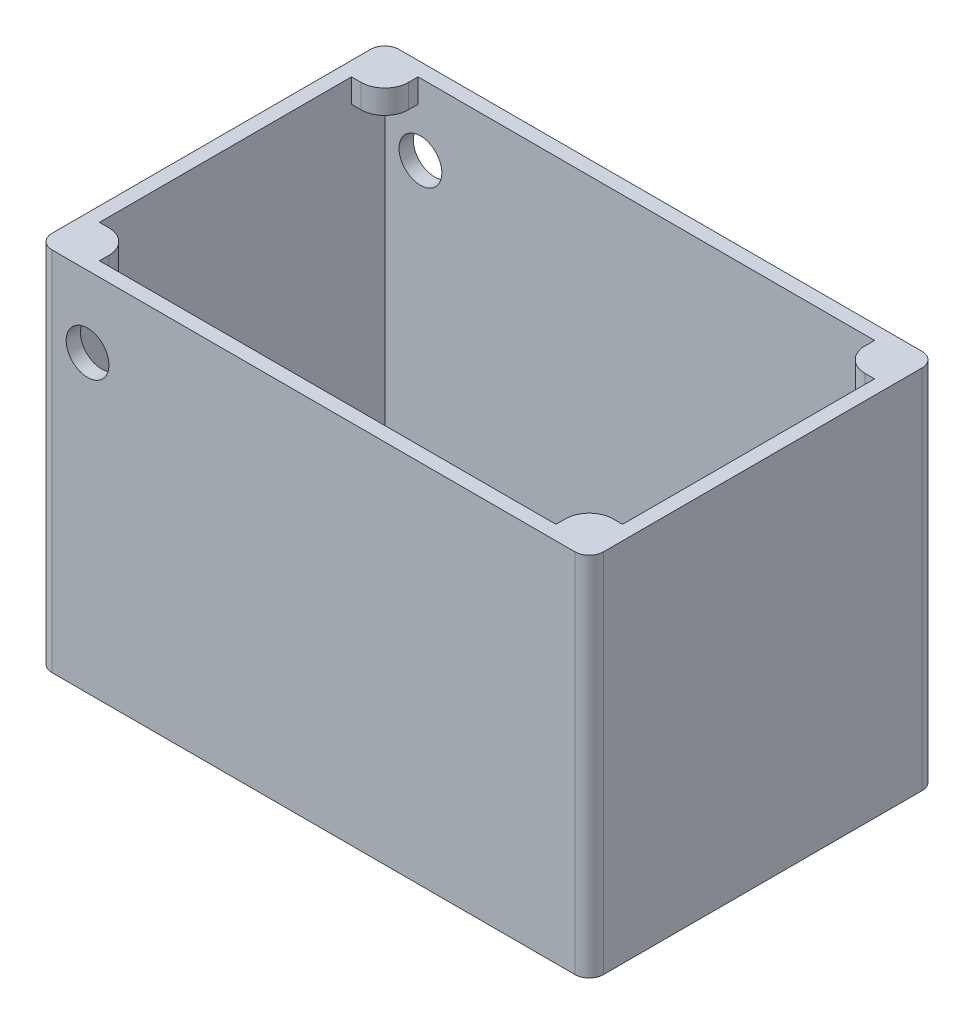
ISO-10303-21;
HEADER;
FILE_DESCRIPTION(('STEP AP214'),'2;1');
FILE_NAME('part.step','',(''),(''),'','','');
FILE_SCHEMA(('AUTOMOTIVE_DESIGN { 1 0 10303 214 1 1 1 1 }'));
ENDSEC;
DATA;
#1=APPLICATION_CONTEXT('core data for automotive mechanical design processes');
#2=APPLICATION_PROTOCOL_DEFINITION('international standard','automotive_design',2000,#1);
#3=PRODUCT_CONTEXT('',#1,'mechanical');
#4=PRODUCT('Part','Part','',(#3));
#5=PRODUCT_RELATED_PRODUCT_CATEGORY('part','',(#4));
#6=PRODUCT_DEFINITION_FORMATION('','',#4);
#7=PRODUCT_DEFINITION_CONTEXT('part definition',#1,'design');
#8=PRODUCT_DEFINITION('design','',#6,#7);
#9=PRODUCT_DEFINITION_SHAPE('','',#8);
#10=(LENGTH_UNIT() NAMED_UNIT(*) SI_UNIT(.MILLI.,.METRE.));
#11=(NAMED_UNIT(*) PLANE_ANGLE_UNIT() SI_UNIT($,.RADIAN.));
#12=(NAMED_UNIT(*) SI_UNIT($,.STERADIAN.) SOLID_ANGLE_UNIT());
#13=UNCERTAINTY_MEASURE_WITH_UNIT(LENGTH_MEASURE(1.E-05),#10,'distance_accuracy_value','');
#14=(GEOMETRIC_REPRESENTATION_CONTEXT(3) GLOBAL_UNCERTAINTY_ASSIGNED_CONTEXT((#13)) GLOBAL_UNIT_ASSIGNED_CONTEXT((#10,
#11,#12)) REPRESENTATION_CONTEXT('',''));
#15=CARTESIAN_POINT('',(0.,0.,0.));
#16=DIRECTION('',(0.,0.,1.));
#17=DIRECTION('',(1.,0.,0.));
#18=AXIS2_PLACEMENT_3D('',#15,#16,#17);
#19=CARTESIAN_POINT('',(53.,72.,31.5));
#20=DIRECTION('',(0.,1.,0.));
#21=DIRECTION('',(0.,0.,1.));
#22=AXIS2_PLACEMENT_3D('',#19,#20,#21);
#23=CYLINDRICAL_SURFACE('',#22,5.);
#24=DIRECTION('',(0.,1.,0.));
#25=VECTOR('',#24,1.);
#26=CARTESIAN_POINT('',(53.,72.,26.5));
#27=LINE('',#26,#25);
#28=CARTESIAN_POINT('',(53.,72.,26.5));
#29=VERTEX_POINT('',#28);
#30=CARTESIAN_POINT('',(53.,77.,26.5));
#31=VERTEX_POINT('',#30);
#32=EDGE_CURVE('E414',#29,#31,#27,.T.);
#33=ORIENTED_EDGE('',*,*,#32,.F.);
#34=CARTESIAN_POINT('',(53.,72.,31.5));
#35=DIRECTION('',(0.,1.,0.));
#36=DIRECTION('',(0.,0.,1.));
#37=AXIS2_PLACEMENT_3D('',#34,#35,#36);
#38=CIRCLE('',#37,5.);
#39=CARTESIAN_POINT('',(48.,72.,31.5));
#40=VERTEX_POINT('',#39);
#41=EDGE_CURVE('E40',#40,#29,#38,.F.);
#42=ORIENTED_EDGE('',*,*,#41,.F.);
#43=DIRECTION('',(0.,1.,0.));
#44=VECTOR('',#43,1.);
#45=CARTESIAN_POINT('',(48.,72.,31.5));
#46=LINE('',#45,#44);
#47=CARTESIAN_POINT('',(48.,77.,31.5));
#48=VERTEX_POINT('',#47);
#49=EDGE_CURVE('E417',#48,#40,#46,.F.);
#50=ORIENTED_EDGE('',*,*,#49,.F.);
#51=CARTESIAN_POINT('',(53.,77.,31.5));
#52=DIRECTION('',(0.,-1.,0.));
#53=DIRECTION('',(0.,0.,-1.));
#54=AXIS2_PLACEMENT_3D('',#51,#52,#53);
#55=CIRCLE('',#54,5.);
#56=EDGE_CURVE('E11',#31,#48,#55,.F.);
#57=ORIENTED_EDGE('',*,*,#56,.F.);
#58=EDGE_LOOP('',(#33,#42,#50,#57));
#59=FACE_BOUND('',#58,.T.);
#60=ADVANCED_FACE('F33',(#59),#23,.T.);
#61=CARTESIAN_POINT('',(53.,72.,-31.5));
#62=DIRECTION('',(0.,-1.,0.));
#63=DIRECTION('',(0.,0.,-1.));
#64=AXIS2_PLACEMENT_3D('',#61,#62,#63);
#65=CYLINDRICAL_SURFACE('',#64,5.);
#66=DIRECTION('',(0.,-1.,0.));
#67=VECTOR('',#66,1.);
#68=CARTESIAN_POINT('',(53.,72.,-26.5));
#69=LINE('',#68,#67);
#70=CARTESIAN_POINT('',(53.,77.,-26.5));
#71=VERTEX_POINT('',#70);
#72=CARTESIAN_POINT('',(53.,72.,-26.5));
#73=VERTEX_POINT('',#72);
#74=EDGE_CURVE('E406',#71,#73,#69,.T.);
#75=ORIENTED_EDGE('',*,*,#74,.F.);
#76=CARTESIAN_POINT('',(53.,77.,-31.5));
#77=DIRECTION('',(0.,-1.,0.));
#78=DIRECTION('',(0.,0.,-1.));
#79=AXIS2_PLACEMENT_3D('',#76,#77,#78);
#80=CIRCLE('',#79,5.);
#81=CARTESIAN_POINT('',(48.,77.,-31.5));
#82=VERTEX_POINT('',#81);
#83=EDGE_CURVE('E410',#82,#71,#80,.F.);
#84=ORIENTED_EDGE('',*,*,#83,.F.);
#85=DIRECTION('',(0.,-1.,0.));
#86=VECTOR('',#85,1.);
#87=CARTESIAN_POINT('',(48.,72.,-31.5));
#88=LINE('',#87,#86);
#89=CARTESIAN_POINT('',(48.,72.,-31.5));
#90=VERTEX_POINT('',#89);
#91=EDGE_CURVE('E241',#90,#82,#88,.F.);
#92=ORIENTED_EDGE('',*,*,#91,.F.);
#93=CARTESIAN_POINT('',(53.,72.,-31.5));
#94=DIRECTION('',(0.,-1.,0.));
#95=DIRECTION('',(0.,0.,-1.));
#96=AXIS2_PLACEMENT_3D('',#93,#94,#95);
#97=CIRCLE('',#96,5.);
#98=EDGE_CURVE('E412',#73,#90,#97,.T.);
#99=ORIENTED_EDGE('',*,*,#98,.F.);
#100=EDGE_LOOP('',(#75,#84,#92,#99));
#101=FACE_BOUND('',#100,.T.);
#102=ADVANCED_FACE('F450',(#101),#65,.T.);
#103=CARTESIAN_POINT('',(-53.,72.,31.5));
#104=DIRECTION('',(0.,-1.,0.));
#105=DIRECTION('',(0.,0.,-1.));
#106=AXIS2_PLACEMENT_3D('',#103,#104,#105);
#107=CYLINDRICAL_SURFACE('',#106,5.);
#108=DIRECTION('',(0.,-1.,0.));
#109=VECTOR('',#108,1.);
#110=CARTESIAN_POINT('',(-53.,72.,26.5));
#111=LINE('',#110,#109);
#112=CARTESIAN_POINT('',(-53.,77.,26.5));
#113=VERTEX_POINT('',#112);
#114=CARTESIAN_POINT('',(-53.,72.,26.5));
#115=VERTEX_POINT('',#114);
#116=EDGE_CURVE('E396',#113,#115,#111,.T.);
#117=ORIENTED_EDGE('',*,*,#116,.F.);
#118=CARTESIAN_POINT('',(-53.,77.,31.5));
#119=DIRECTION('',(0.,-1.,0.));
#120=DIRECTION('',(0.,0.,-1.));
#121=AXIS2_PLACEMENT_3D('',#118,#119,#120);
#122=CIRCLE('',#121,5.);
#123=CARTESIAN_POINT('',(-48.,77.,31.5));
#124=VERTEX_POINT('',#123);
#125=EDGE_CURVE('E402',#124,#113,#122,.F.);
#126=ORIENTED_EDGE('',*,*,#125,.F.);
#127=DIRECTION('',(0.,-1.,0.));
#128=VECTOR('',#127,1.);
#129=CARTESIAN_POINT('',(-48.,72.,31.5));
#130=LINE('',#129,#128);
#131=CARTESIAN_POINT('',(-48.,72.,31.5));
#132=VERTEX_POINT('',#131);
#133=EDGE_CURVE('E399',#132,#124,#130,.F.);
#134=ORIENTED_EDGE('',*,*,#133,.F.);
#135=CARTESIAN_POINT('',(-53.,72.,31.5));
#136=DIRECTION('',(0.,-1.,0.));
#137=DIRECTION('',(0.,0.,-1.));
#138=AXIS2_PLACEMENT_3D('',#135,#136,#137);
#139=CIRCLE('',#138,5.);
#140=EDGE_CURVE('E404',#115,#132,#139,.T.);
#141=ORIENTED_EDGE('',*,*,#140,.F.);
#142=EDGE_LOOP('',(#117,#126,#134,#141));
#143=FACE_BOUND('',#142,.T.);
#144=ADVANCED_FACE('F452',(#143),#107,.T.);
#145=CARTESIAN_POINT('',(-53.,72.,-31.5));
#146=DIRECTION('',(0.,1.,0.));
#147=DIRECTION('',(0.,0.,1.));
#148=AXIS2_PLACEMENT_3D('',#145,#146,#147);
#149=CYLINDRICAL_SURFACE('',#148,5.);
#150=DIRECTION('',(0.,1.,0.));
#151=VECTOR('',#150,1.);
#152=CARTESIAN_POINT('',(-53.,72.,-26.5));
#153=LINE('',#152,#151);
#154=CARTESIAN_POINT('',(-53.,72.,-26.5));
#155=VERTEX_POINT('',#154);
#156=CARTESIAN_POINT('',(-53.,77.,-26.5));
#157=VERTEX_POINT('',#156);
#158=EDGE_CURVE('E386',#155,#157,#153,.T.);
#159=ORIENTED_EDGE('',*,*,#158,.F.);
#160=CARTESIAN_POINT('',(-53.,72.,-31.5));
#161=DIRECTION('',(0.,1.,0.));
#162=DIRECTION('',(0.,0.,1.));
#163=AXIS2_PLACEMENT_3D('',#160,#161,#162);
#164=CIRCLE('',#163,5.);
#165=CARTESIAN_POINT('',(-48.,72.,-31.5));
#166=VERTEX_POINT('',#165);
#167=EDGE_CURVE('E392',#166,#155,#164,.F.);
#168=ORIENTED_EDGE('',*,*,#167,.F.);
#169=DIRECTION('',(0.,1.,0.));
#170=VECTOR('',#169,1.);
#171=CARTESIAN_POINT('',(-48.,72.,-31.5));
#172=LINE('',#171,#170);
#173=CARTESIAN_POINT('',(-48.,77.,-31.5));
#174=VERTEX_POINT('',#173);
#175=EDGE_CURVE('E389',#174,#166,#172,.F.);
#176=ORIENTED_EDGE('',*,*,#175,.F.);
#177=CARTESIAN_POINT('',(-53.,77.,-31.5));
#178=DIRECTION('',(0.,-1.,0.));
#179=DIRECTION('',(0.,0.,-1.));
#180=AXIS2_PLACEMENT_3D('',#177,#178,#179);
#181=CIRCLE('',#180,5.);
#182=EDGE_CURVE('E394',#157,#174,#181,.F.);
#183=ORIENTED_EDGE('',*,*,#182,.F.);
#184=EDGE_LOOP('',(#159,#168,#176,#183));
#185=FACE_BOUND('',#184,.T.);
#186=ADVANCED_FACE('F457',(#185),#149,.T.);
#187=CARTESIAN_POINT('',(55.,77.,-33.5));
#188=DIRECTION('',(0.,1.,0.));
#189=DIRECTION('',(0.,0.,1.));
#190=AXIS2_PLACEMENT_3D('',#187,#188,#189);
#191=CYLINDRICAL_SURFACE('',#190,3.);
#192=DIRECTION('',(0.,1.,0.));
#193=VECTOR('',#192,1.);
#194=CARTESIAN_POINT('',(58.,77.,-33.5));
#195=LINE('',#194,#193);
#196=CARTESIAN_POINT('',(58.,0.,-33.5));
#197=VERTEX_POINT('',#196);
#198=CARTESIAN_POINT('',(58.,77.,-33.5));
#199=VERTEX_POINT('',#198);
#200=EDGE_CURVE('E376',#197,#199,#195,.T.);
#201=ORIENTED_EDGE('',*,*,#200,.F.);
#202=CARTESIAN_POINT('',(55.,0.,-33.5));
#203=DIRECTION('',(0.,-1.,0.));
#204=DIRECTION('',(0.,0.,-1.));
#205=AXIS2_PLACEMENT_3D('',#202,#203,#204);
#206=CIRCLE('',#205,3.);
#207=CARTESIAN_POINT('',(55.,0.,-36.5));
#208=VERTEX_POINT('',#207);
#209=EDGE_CURVE('E382',#208,#197,#206,.T.);
#210=ORIENTED_EDGE('',*,*,#209,.F.);
#211=DIRECTION('',(0.,1.,0.));
#212=VECTOR('',#211,1.);
#213=CARTESIAN_POINT('',(55.,77.,-36.5));
#214=LINE('',#213,#212);
#215=CARTESIAN_POINT('',(55.,77.,-36.5));
#216=VERTEX_POINT('',#215);
#217=EDGE_CURVE('E379',#216,#208,#214,.F.);
#218=ORIENTED_EDGE('',*,*,#217,.F.);
#219=CARTESIAN_POINT('',(55.,77.,-33.5));
#220=DIRECTION('',(0.,-1.,0.));
#221=DIRECTION('',(0.,0.,-1.));
#222=AXIS2_PLACEMENT_3D('',#219,#220,#221);
#223=CIRCLE('',#222,3.);
#224=EDGE_CURVE('E384',#199,#216,#223,.F.);
#225=ORIENTED_EDGE('',*,*,#224,.F.);
#226=EDGE_LOOP('',(#201,#210,#218,#225));
#227=FACE_BOUND('',#226,.T.);
#228=ADVANCED_FACE('F463',(#227),#191,.T.);
#229=CARTESIAN_POINT('',(55.,77.,33.5));
#230=DIRECTION('',(0.,-1.,0.));
#231=DIRECTION('',(0.,0.,-1.));
#232=AXIS2_PLACEMENT_3D('',#229,#230,#231);
#233=CYLINDRICAL_SURFACE('',#232,3.);
#234=DIRECTION('',(0.,-1.,0.));
#235=VECTOR('',#234,1.);
#236=CARTESIAN_POINT('',(58.,77.,33.5));
#237=LINE('',#236,#235);
#238=CARTESIAN_POINT('',(58.,77.,33.5));
#239=VERTEX_POINT('',#238);
#240=CARTESIAN_POINT('',(58.,0.,33.5));
#241=VERTEX_POINT('',#240);
#242=EDGE_CURVE('E366',#239,#241,#237,.T.);
#243=ORIENTED_EDGE('',*,*,#242,.F.);
#244=CARTESIAN_POINT('',(55.,77.,33.5));
#245=DIRECTION('',(0.,-1.,0.));
#246=DIRECTION('',(0.,0.,-1.));
#247=AXIS2_PLACEMENT_3D('',#244,#245,#246);
#248=CIRCLE('',#247,3.);
#249=CARTESIAN_POINT('',(55.,77.,36.5));
#250=VERTEX_POINT('',#249);
#251=EDGE_CURVE('E372',#250,#239,#248,.F.);
#252=ORIENTED_EDGE('',*,*,#251,.F.);
#253=DIRECTION('',(0.,-1.,0.));
#254=VECTOR('',#253,1.);
#255=CARTESIAN_POINT('',(55.,77.,36.5));
#256=LINE('',#255,#254);
#257=CARTESIAN_POINT('',(55.,0.,36.5));
#258=VERTEX_POINT('',#257);
#259=EDGE_CURVE('E369',#258,#250,#256,.F.);
#260=ORIENTED_EDGE('',*,*,#259,.F.);
#261=CARTESIAN_POINT('',(55.,0.,33.5));
#262=DIRECTION('',(0.,-1.,0.));
#263=DIRECTION('',(0.,0.,-1.));
#264=AXIS2_PLACEMENT_3D('',#261,#262,#263);
#265=CIRCLE('',#264,3.);
#266=EDGE_CURVE('E374',#241,#258,#265,.T.);
#267=ORIENTED_EDGE('',*,*,#266,.F.);
#268=EDGE_LOOP('',(#243,#252,#260,#267));
#269=FACE_BOUND('',#268,.T.);
#270=ADVANCED_FACE('F467',(#269),#233,.T.);
#271=CARTESIAN_POINT('',(-55.,77.,33.5));
#272=DIRECTION('',(0.,-1.,0.));
#273=DIRECTION('',(0.,0.,-1.));
#274=AXIS2_PLACEMENT_3D('',#271,#272,#273);
#275=CYLINDRICAL_SURFACE('',#274,3.);
#276=DIRECTION('',(0.,-1.,0.));
#277=VECTOR('',#276,1.);
#278=CARTESIAN_POINT('',(-55.,77.,36.5));
#279=LINE('',#278,#277);
#280=CARTESIAN_POINT('',(-55.,77.,36.5));
#281=VERTEX_POINT('',#280);
#282=CARTESIAN_POINT('',(-55.,0.,36.5));
#283=VERTEX_POINT('',#282);
#284=EDGE_CURVE('E356',#281,#283,#279,.T.);
#285=ORIENTED_EDGE('',*,*,#284,.F.);
#286=CARTESIAN_POINT('',(-55.,77.,33.5));
#287=DIRECTION('',(0.,-1.,0.));
#288=DIRECTION('',(0.,0.,-1.));
#289=AXIS2_PLACEMENT_3D('',#286,#287,#288);
#290=CIRCLE('',#289,3.);
#291=CARTESIAN_POINT('',(-58.,77.,33.5));
#292=VERTEX_POINT('',#291);
#293=EDGE_CURVE('E362',#292,#281,#290,.F.);
#294=ORIENTED_EDGE('',*,*,#293,.F.);
#295=DIRECTION('',(0.,-1.,0.));
#296=VECTOR('',#295,1.);
#297=CARTESIAN_POINT('',(-58.,77.,33.5));
#298=LINE('',#297,#296);
#299=CARTESIAN_POINT('',(-58.,0.,33.5));
#300=VERTEX_POINT('',#299);
#301=EDGE_CURVE('E359',#300,#292,#298,.F.);
#302=ORIENTED_EDGE('',*,*,#301,.F.);
#303=CARTESIAN_POINT('',(-55.,0.,33.5));
#304=DIRECTION('',(0.,-1.,0.));
#305=DIRECTION('',(0.,0.,-1.));
#306=AXIS2_PLACEMENT_3D('',#303,#304,#305);
#307=CIRCLE('',#306,3.);
#308=EDGE_CURVE('E364',#283,#300,#307,.T.);
#309=ORIENTED_EDGE('',*,*,#308,.F.);
#310=EDGE_LOOP('',(#285,#294,#302,#309));
#311=FACE_BOUND('',#310,.T.);
#312=ADVANCED_FACE('F471',(#311),#275,.T.);
#313=CARTESIAN_POINT('',(-55.,77.,-33.5));
#314=DIRECTION('',(0.,1.,0.));
#315=DIRECTION('',(0.,0.,1.));
#316=AXIS2_PLACEMENT_3D('',#313,#314,#315);
#317=CYLINDRICAL_SURFACE('',#316,3.);
#318=DIRECTION('',(0.,1.,0.));
#319=VECTOR('',#318,1.);
#320=CARTESIAN_POINT('',(-55.,77.,-36.5));
#321=LINE('',#320,#319);
#322=CARTESIAN_POINT('',(-55.,0.,-36.5));
#323=VERTEX_POINT('',#322);
#324=CARTESIAN_POINT('',(-55.,77.,-36.5));
#325=VERTEX_POINT('',#324);
#326=EDGE_CURVE('E345',#323,#325,#321,.T.);
#327=ORIENTED_EDGE('',*,*,#326,.F.);
#328=CARTESIAN_POINT('',(-55.,0.,-33.5));
#329=DIRECTION('',(0.,-1.,0.));
#330=DIRECTION('',(0.,0.,-1.));
#331=AXIS2_PLACEMENT_3D('',#328,#329,#330);
#332=CIRCLE('',#331,3.);
#333=CARTESIAN_POINT('',(-58.,0.,-33.5));
#334=VERTEX_POINT('',#333);
#335=EDGE_CURVE('E351',#334,#323,#332,.T.);
#336=ORIENTED_EDGE('',*,*,#335,.F.);
#337=DIRECTION('',(0.,1.,0.));
#338=VECTOR('',#337,1.);
#339=CARTESIAN_POINT('',(-58.,77.,-33.5));
#340=LINE('',#339,#338);
#341=CARTESIAN_POINT('',(-58.,77.,-33.5));
#342=VERTEX_POINT('',#341);
#343=EDGE_CURVE('E348',#342,#334,#340,.F.);
#344=ORIENTED_EDGE('',*,*,#343,.F.);
#345=CARTESIAN_POINT('',(-55.,77.,-33.5));
#346=DIRECTION('',(0.,-1.,0.));
#347=DIRECTION('',(0.,0.,-1.));
#348=AXIS2_PLACEMENT_3D('',#345,#346,#347);
#349=CIRCLE('',#348,3.);
#350=EDGE_CURVE('E354',#325,#342,#349,.F.);
#351=ORIENTED_EDGE('',*,*,#350,.F.);
#352=EDGE_LOOP('',(#327,#336,#344,#351));
#353=FACE_BOUND('',#352,.T.);
#354=ADVANCED_FACE('F475',(#353),#317,.T.);
#355=CARTESIAN_POINT('',(58.,77.,36.5));
#356=DIRECTION('',(-1.,0.,0.));
#357=DIRECTION('',(0.,0.,1.));
#358=AXIS2_PLACEMENT_3D('',#355,#356,#357);
#359=PLANE('',#358);
#360=DIRECTION('',(0.,0.,-1.));
#361=VECTOR('',#360,1.);
#362=CARTESIAN_POINT('',(58.,0.,36.5));
#363=LINE('',#362,#361);
#364=EDGE_CURVE('E289',#241,#197,#363,.T.);
#365=ORIENTED_EDGE('',*,*,#364,.T.);
#366=ORIENTED_EDGE('',*,*,#200,.T.);
#367=DIRECTION('',(0.,0.,-1.));
#368=VECTOR('',#367,1.);
#369=CARTESIAN_POINT('',(58.,77.,36.5));
#370=LINE('',#369,#368);
#371=EDGE_CURVE('E297',#239,#199,#370,.T.);
#372=ORIENTED_EDGE('',*,*,#371,.F.);
#373=ORIENTED_EDGE('',*,*,#242,.T.);
#374=EDGE_LOOP('',(#365,#366,#372,#373));
#375=FACE_BOUND('',#374,.T.);
#376=ADVANCED_FACE('F479',(#375),#359,.F.);
#377=CARTESIAN_POINT('',(-58.,77.,-36.5));
#378=DIRECTION('',(0.,0.,1.));
#379=DIRECTION('',(1.,0.,0.));
#380=AXIS2_PLACEMENT_3D('',#377,#378,#379);
#381=PLANE('',#380);
#382=DIRECTION('',(-1.,0.,0.));
#383=VECTOR('',#382,1.);
#384=CARTESIAN_POINT('',(-58.,77.,-36.5));
#385=LINE('',#384,#383);
#386=EDGE_CURVE('E300',#216,#325,#385,.T.);
#387=ORIENTED_EDGE('',*,*,#386,.F.);
#388=ORIENTED_EDGE('',*,*,#217,.T.);
#389=DIRECTION('',(-1.,0.,0.));
#390=VECTOR('',#389,1.);
#391=CARTESIAN_POINT('',(-58.,0.,-36.5));
#392=LINE('',#391,#390);
#393=EDGE_CURVE('E311',#208,#323,#392,.T.);
#394=ORIENTED_EDGE('',*,*,#393,.T.);
#395=ORIENTED_EDGE('',*,*,#326,.T.);
#396=EDGE_LOOP('',(#387,#388,#394,#395));
#397=FACE_BOUND('',#396,.T.);
#398=CARTESIAN_POINT('',(-47.5,62.,-36.5));
#399=DIRECTION('',(0.,0.,-1.));
#400=DIRECTION('',(-1.,0.,0.));
#401=AXIS2_PLACEMENT_3D('',#398,#399,#400);
#402=CIRCLE('',#401,4.5);
#403=CARTESIAN_POINT('',(-52.,62.,-36.5));
#404=VERTEX_POINT('',#403);
#405=EDGE_CURVE('E256',#404,#404,#402,.T.);
#406=ORIENTED_EDGE('',*,*,#405,.F.);
#407=EDGE_LOOP('',(#406));
#408=FACE_BOUND('',#407,.T.);
#409=ADVANCED_FACE('F483',(#397,#408),#381,.F.);
#410=CARTESIAN_POINT('',(-58.,77.,36.5));
#411=DIRECTION('',(1.,0.,0.));
#412=DIRECTION('',(0.,0.,-1.));
#413=AXIS2_PLACEMENT_3D('',#410,#411,#412);
#414=PLANE('',#413);
#415=DIRECTION('',(0.,0.,1.));
#416=VECTOR('',#415,1.);
#417=CARTESIAN_POINT('',(-58.,0.,36.5));
#418=LINE('',#417,#416);
#419=EDGE_CURVE('E313',#334,#300,#418,.T.);
#420=ORIENTED_EDGE('',*,*,#419,.T.);
#421=ORIENTED_EDGE('',*,*,#301,.T.);
#422=DIRECTION('',(0.,0.,1.));
#423=VECTOR('',#422,1.);
#424=CARTESIAN_POINT('',(-58.,77.,36.5));
#425=LINE('',#424,#423);
#426=EDGE_CURVE('E303',#342,#292,#425,.T.);
#427=ORIENTED_EDGE('',*,*,#426,.F.);
#428=ORIENTED_EDGE('',*,*,#343,.T.);
#429=EDGE_LOOP('',(#420,#421,#427,#428));
#430=FACE_BOUND('',#429,.T.);
#431=ADVANCED_FACE('F487',(#430),#414,.F.);
#432=CARTESIAN_POINT('',(-58.,77.,36.5));
#433=DIRECTION('',(0.,0.,-1.));
#434=DIRECTION('',(-1.,0.,0.));
#435=AXIS2_PLACEMENT_3D('',#432,#433,#434);
#436=PLANE('',#435);
#437=DIRECTION('',(1.,0.,0.));
#438=VECTOR('',#437,1.);
#439=CARTESIAN_POINT('',(-58.,0.,36.5));
#440=LINE('',#439,#438);
#441=EDGE_CURVE('E301',#283,#258,#440,.T.);
#442=ORIENTED_EDGE('',*,*,#441,.T.);
#443=ORIENTED_EDGE('',*,*,#259,.T.);
#444=DIRECTION('',(1.,0.,0.));
#445=VECTOR('',#444,1.);
#446=CARTESIAN_POINT('',(-58.,77.,36.5));
#447=LINE('',#446,#445);
#448=EDGE_CURVE('E306',#281,#250,#447,.T.);
#449=ORIENTED_EDGE('',*,*,#448,.F.);
#450=ORIENTED_EDGE('',*,*,#284,.T.);
#451=EDGE_LOOP('',(#442,#443,#449,#450));
#452=FACE_BOUND('',#451,.T.);
#453=CARTESIAN_POINT('',(-47.5,62.,36.5));
#454=DIRECTION('',(0.,0.,-1.));
#455=DIRECTION('',(-1.,0.,0.));
#456=AXIS2_PLACEMENT_3D('',#453,#454,#455);
#457=CIRCLE('',#456,4.5);
#458=CARTESIAN_POINT('',(-52.,62.,36.5));
#459=VERTEX_POINT('',#458);
#460=EDGE_CURVE('E259',#459,#459,#457,.T.);
#461=ORIENTED_EDGE('',*,*,#460,.T.);
#462=EDGE_LOOP('',(#461));
#463=FACE_BOUND('',#462,.T.);
#464=ADVANCED_FACE('F491',(#452,#463),#436,.F.);
#465=CARTESIAN_POINT('',(0.,77.,0.));
#466=DIRECTION('',(0.,-1.,0.));
#467=DIRECTION('',(0.,0.,-1.));
#468=AXIS2_PLACEMENT_3D('',#465,#466,#467);
#469=PLANE('',#468);
#470=DIRECTION('',(-1.,0.,0.));
#471=VECTOR('',#470,1.);
#472=CARTESIAN_POINT('',(58.,77.,26.5));
#473=LINE('',#472,#471);
#474=CARTESIAN_POINT('',(55.,77.,26.5));
#475=VERTEX_POINT('',#474);
#476=EDGE_CURVE('E431',#475,#31,#473,.T.);
#477=ORIENTED_EDGE('',*,*,#476,.T.);
#478=ORIENTED_EDGE('',*,*,#56,.T.);
#479=DIRECTION('',(0.,0.,1.));
#480=VECTOR('',#479,1.);
#481=CARTESIAN_POINT('',(48.,77.,36.5));
#482=LINE('',#481,#480);
#483=CARTESIAN_POINT('',(48.,77.,33.5));
#484=VERTEX_POINT('',#483);
#485=EDGE_CURVE('E428',#48,#484,#482,.T.);
#486=ORIENTED_EDGE('',*,*,#485,.T.);
#487=DIRECTION('',(1.,0.,0.));
#488=VECTOR('',#487,1.);
#489=CARTESIAN_POINT('',(-55.,77.,33.5));
#490=LINE('',#489,#488);
#491=CARTESIAN_POINT('',(-48.,77.,33.5));
#492=VERTEX_POINT('',#491);
#493=EDGE_CURVE('E270',#492,#484,#490,.T.);
#494=ORIENTED_EDGE('',*,*,#493,.F.);
#495=DIRECTION('',(0.,0.,-1.));
#496=VECTOR('',#495,1.);
#497=CARTESIAN_POINT('',(-48.,77.,36.5));
#498=LINE('',#497,#496);
#499=EDGE_CURVE('E579',#492,#124,#498,.T.);
#500=ORIENTED_EDGE('',*,*,#499,.T.);
#501=ORIENTED_EDGE('',*,*,#125,.T.);
#502=DIRECTION('',(-1.,0.,0.));
#503=VECTOR('',#502,1.);
#504=CARTESIAN_POINT('',(-58.,77.,26.5));
#505=LINE('',#504,#503);
#506=CARTESIAN_POINT('',(-55.,77.,26.5));
#507=VERTEX_POINT('',#506);
#508=EDGE_CURVE('E576',#113,#507,#505,.T.);
#509=ORIENTED_EDGE('',*,*,#508,.T.);
#510=DIRECTION('',(0.,0.,1.));
#511=VECTOR('',#510,1.);
#512=CARTESIAN_POINT('',(-55.,77.,33.5));
#513=LINE('',#512,#511);
#514=CARTESIAN_POINT('',(-55.,77.,-26.5));
#515=VERTEX_POINT('',#514);
#516=EDGE_CURVE('E224',#515,#507,#513,.T.);
#517=ORIENTED_EDGE('',*,*,#516,.F.);
#518=DIRECTION('',(1.,0.,0.));
#519=VECTOR('',#518,1.);
#520=CARTESIAN_POINT('',(-58.,77.,-26.5));
#521=LINE('',#520,#519);
#522=EDGE_CURVE('E573',#515,#157,#521,.T.);
#523=ORIENTED_EDGE('',*,*,#522,.T.);
#524=ORIENTED_EDGE('',*,*,#182,.T.);
#525=DIRECTION('',(0.,0.,-1.));
#526=VECTOR('',#525,1.);
#527=CARTESIAN_POINT('',(-48.,77.,-36.5));
#528=LINE('',#527,#526);
#529=CARTESIAN_POINT('',(-48.,77.,-33.5));
#530=VERTEX_POINT('',#529);
#531=EDGE_CURVE('E220',#174,#530,#528,.T.);
#532=ORIENTED_EDGE('',*,*,#531,.T.);
#533=DIRECTION('',(-1.,0.,0.));
#534=VECTOR('',#533,1.);
#535=CARTESIAN_POINT('',(-55.,77.,-33.5));
#536=LINE('',#535,#534);
#537=CARTESIAN_POINT('',(48.,77.,-33.5));
#538=VERTEX_POINT('',#537);
#539=EDGE_CURVE('E213',#538,#530,#536,.T.);
#540=ORIENTED_EDGE('',*,*,#539,.F.);
#541=DIRECTION('',(0.,0.,1.));
#542=VECTOR('',#541,1.);
#543=CARTESIAN_POINT('',(48.,77.,-36.5));
#544=LINE('',#543,#542);
#545=EDGE_CURVE('E218',#538,#82,#544,.T.);
#546=ORIENTED_EDGE('',*,*,#545,.T.);
#547=ORIENTED_EDGE('',*,*,#83,.T.);
#548=DIRECTION('',(1.,0.,0.));
#549=VECTOR('',#548,1.);
#550=CARTESIAN_POINT('',(58.,77.,-26.5));
#551=LINE('',#550,#549);
#552=CARTESIAN_POINT('',(55.,77.,-26.5));
#553=VERTEX_POINT('',#552);
#554=EDGE_CURVE('E242',#71,#553,#551,.T.);
#555=ORIENTED_EDGE('',*,*,#554,.T.);
#556=DIRECTION('',(0.,0.,-1.));
#557=VECTOR('',#556,1.);
#558=CARTESIAN_POINT('',(55.,77.,33.5));
#559=LINE('',#558,#557);
#560=EDGE_CURVE('E225',#475,#553,#559,.T.);
#561=ORIENTED_EDGE('',*,*,#560,.F.);
#562=EDGE_LOOP('',(#477,#478,#486,#494,#500,#501,#509,#517,#523,#524,#532,#540,#546,#547,#555,#561));
#563=FACE_BOUND('',#562,.T.);
#564=ORIENTED_EDGE('',*,*,#371,.T.);
#565=ORIENTED_EDGE('',*,*,#224,.T.);
#566=ORIENTED_EDGE('',*,*,#386,.T.);
#567=ORIENTED_EDGE('',*,*,#350,.T.);
#568=ORIENTED_EDGE('',*,*,#426,.T.);
#569=ORIENTED_EDGE('',*,*,#293,.T.);
#570=ORIENTED_EDGE('',*,*,#448,.T.);
#571=ORIENTED_EDGE('',*,*,#251,.T.);
#572=EDGE_LOOP('',(#564,#565,#566,#567,#568,#569,#570,#571));
#573=FACE_BOUND('',#572,.T.);
#574=ADVANCED_FACE('F215',(#563,#573),#469,.F.);
#575=CARTESIAN_POINT('',(0.,0.,0.));
#576=DIRECTION('',(0.,-1.,0.));
#577=DIRECTION('',(0.,0.,-1.));
#578=AXIS2_PLACEMENT_3D('',#575,#576,#577);
#579=PLANE('',#578);
#580=ORIENTED_EDGE('',*,*,#393,.F.);
#581=ORIENTED_EDGE('',*,*,#209,.T.);
#582=ORIENTED_EDGE('',*,*,#364,.F.);
#583=ORIENTED_EDGE('',*,*,#266,.T.);
#584=ORIENTED_EDGE('',*,*,#441,.F.);
#585=ORIENTED_EDGE('',*,*,#308,.T.);
#586=ORIENTED_EDGE('',*,*,#419,.F.);
#587=ORIENTED_EDGE('',*,*,#335,.T.);
#588=EDGE_LOOP('',(#580,#581,#582,#583,#584,#585,#586,#587));
#589=FACE_BOUND('',#588,.T.);
#590=ADVANCED_FACE('F496',(#589),#579,.T.);
#591=CARTESIAN_POINT('',(55.,3.5,33.5));
#592=DIRECTION('',(1.,0.,0.));
#593=DIRECTION('',(0.,0.,-1.));
#594=AXIS2_PLACEMENT_3D('',#591,#592,#593);
#595=PLANE('',#594);
#596=DIRECTION('',(0.,0.,1.));
#597=VECTOR('',#596,1.);
#598=CARTESIAN_POINT('',(55.,72.,33.5));
#599=LINE('',#598,#597);
#600=CARTESIAN_POINT('',(55.,72.,26.5));
#601=VERTEX_POINT('',#600);
#602=CARTESIAN_POINT('',(55.,72.,33.5));
#603=VERTEX_POINT('',#602);
#604=EDGE_CURVE('E243',#601,#603,#599,.T.);
#605=ORIENTED_EDGE('',*,*,#604,.F.);
#606=DIRECTION('',(0.,1.,0.));
#607=VECTOR('',#606,1.);
#608=CARTESIAN_POINT('',(55.,3.5,26.5));
#609=LINE('',#608,#607);
#610=EDGE_CURVE('E329',#601,#475,#609,.T.);
#611=ORIENTED_EDGE('',*,*,#610,.T.);
#612=ORIENTED_EDGE('',*,*,#560,.T.);
#613=DIRECTION('',(0.,-1.,0.));
#614=VECTOR('',#613,1.);
#615=CARTESIAN_POINT('',(55.,3.5,-26.5));
#616=LINE('',#615,#614);
#617=CARTESIAN_POINT('',(55.,72.,-26.5));
#618=VERTEX_POINT('',#617);
#619=EDGE_CURVE('E236',#553,#618,#616,.T.);
#620=ORIENTED_EDGE('',*,*,#619,.T.);
#621=DIRECTION('',(0.,0.,-1.));
#622=VECTOR('',#621,1.);
#623=CARTESIAN_POINT('',(55.,72.,33.5));
#624=LINE('',#623,#622);
#625=CARTESIAN_POINT('',(55.,72.,-33.5));
#626=VERTEX_POINT('',#625);
#627=EDGE_CURVE('E254',#618,#626,#624,.T.);
#628=ORIENTED_EDGE('',*,*,#627,.T.);
#629=DIRECTION('',(0.,1.,0.));
#630=VECTOR('',#629,1.);
#631=CARTESIAN_POINT('',(55.,3.5,-33.5));
#632=LINE('',#631,#630);
#633=CARTESIAN_POINT('',(55.,3.5,-33.5));
#634=VERTEX_POINT('',#633);
#635=EDGE_CURVE('E279',#634,#626,#632,.T.);
#636=ORIENTED_EDGE('',*,*,#635,.F.);
#637=DIRECTION('',(0.,0.,-1.));
#638=VECTOR('',#637,1.);
#639=CARTESIAN_POINT('',(55.,3.5,33.5));
#640=LINE('',#639,#638);
#641=CARTESIAN_POINT('',(55.,3.5,33.5));
#642=VERTEX_POINT('',#641);
#643=EDGE_CURVE('E266',#642,#634,#640,.T.);
#644=ORIENTED_EDGE('',*,*,#643,.F.);
#645=DIRECTION('',(0.,1.,0.));
#646=VECTOR('',#645,1.);
#647=CARTESIAN_POINT('',(55.,3.5,33.5));
#648=LINE('',#647,#646);
#649=EDGE_CURVE('E286',#642,#603,#648,.T.);
#650=ORIENTED_EDGE('',*,*,#649,.T.);
#651=EDGE_LOOP('',(#605,#611,#612,#620,#628,#636,#644,#650));
#652=FACE_BOUND('',#651,.T.);
#653=ADVANCED_FACE('F446',(#652),#595,.F.);
#654=CARTESIAN_POINT('',(-55.,3.5,33.5));
#655=DIRECTION('',(0.,0.,1.));
#656=DIRECTION('',(1.,0.,0.));
#657=AXIS2_PLACEMENT_3D('',#654,#655,#656);
#658=PLANE('',#657);
#659=CARTESIAN_POINT('',(-47.5,62.,33.5));
#660=DIRECTION('',(0.,0.,1.));
#661=DIRECTION('',(1.,0.,0.));
#662=AXIS2_PLACEMENT_3D('',#659,#660,#661);
#663=CIRCLE('',#662,4.5);
#664=CARTESIAN_POINT('',(-43.,62.,33.5));
#665=VERTEX_POINT('',#664);
#666=EDGE_CURVE('E263',#665,#665,#663,.T.);
#667=ORIENTED_EDGE('',*,*,#666,.T.);
#668=EDGE_LOOP('',(#667));
#669=FACE_BOUND('',#668,.T.);
#670=DIRECTION('',(1.,0.,0.));
#671=VECTOR('',#670,1.);
#672=CARTESIAN_POINT('',(-55.,72.,33.5));
#673=LINE('',#672,#671);
#674=CARTESIAN_POINT('',(-55.,72.,33.5));
#675=VERTEX_POINT('',#674);
#676=CARTESIAN_POINT('',(-48.,72.,33.5));
#677=VERTEX_POINT('',#676);
#678=EDGE_CURVE('E570',#675,#677,#673,.T.);
#679=ORIENTED_EDGE('',*,*,#678,.T.);
#680=DIRECTION('',(0.,1.,0.));
#681=VECTOR('',#680,1.);
#682=CARTESIAN_POINT('',(-48.,3.5,33.5));
#683=LINE('',#682,#681);
#684=EDGE_CURVE('E343',#677,#492,#683,.T.);
#685=ORIENTED_EDGE('',*,*,#684,.T.);
#686=ORIENTED_EDGE('',*,*,#493,.T.);
#687=DIRECTION('',(0.,-1.,0.));
#688=VECTOR('',#687,1.);
#689=CARTESIAN_POINT('',(48.,3.5,33.5));
#690=LINE('',#689,#688);
#691=CARTESIAN_POINT('',(48.,72.,33.5));
#692=VERTEX_POINT('',#691);
#693=EDGE_CURVE('E326',#484,#692,#690,.T.);
#694=ORIENTED_EDGE('',*,*,#693,.T.);
#695=DIRECTION('',(-1.,0.,0.));
#696=VECTOR('',#695,1.);
#697=CARTESIAN_POINT('',(-55.,72.,33.5));
#698=LINE('',#697,#696);
#699=EDGE_CURVE('E323',#603,#692,#698,.T.);
#700=ORIENTED_EDGE('',*,*,#699,.F.);
#701=ORIENTED_EDGE('',*,*,#649,.F.);
#702=DIRECTION('',(1.,0.,0.));
#703=VECTOR('',#702,1.);
#704=CARTESIAN_POINT('',(-55.,3.5,33.5));
#705=LINE('',#704,#703);
#706=CARTESIAN_POINT('',(-55.,3.5,33.5));
#707=VERTEX_POINT('',#706);
#708=EDGE_CURVE('E276',#707,#642,#705,.T.);
#709=ORIENTED_EDGE('',*,*,#708,.F.);
#710=DIRECTION('',(0.,1.,0.));
#711=VECTOR('',#710,1.);
#712=CARTESIAN_POINT('',(-55.,3.5,33.5));
#713=LINE('',#712,#711);
#714=EDGE_CURVE('E290',#707,#675,#713,.T.);
#715=ORIENTED_EDGE('',*,*,#714,.T.);
#716=EDGE_LOOP('',(#679,#685,#686,#694,#700,#701,#709,#715));
#717=FACE_BOUND('',#716,.T.);
#718=ADVANCED_FACE('F504',(#669,#717),#658,.F.);
#719=CARTESIAN_POINT('',(-55.,3.5,33.5));
#720=DIRECTION('',(-1.,0.,0.));
#721=DIRECTION('',(0.,0.,1.));
#722=AXIS2_PLACEMENT_3D('',#719,#720,#721);
#723=PLANE('',#722);
#724=ORIENTED_EDGE('',*,*,#516,.T.);
#725=DIRECTION('',(0.,-1.,0.));
#726=VECTOR('',#725,1.);
#727=CARTESIAN_POINT('',(-55.,3.5,26.5));
#728=LINE('',#727,#726);
#729=CARTESIAN_POINT('',(-55.,72.,26.5));
#730=VERTEX_POINT('',#729);
#731=EDGE_CURVE('E340',#507,#730,#728,.T.);
#732=ORIENTED_EDGE('',*,*,#731,.T.);
#733=DIRECTION('',(0.,0.,1.));
#734=VECTOR('',#733,1.);
#735=CARTESIAN_POINT('',(-55.,72.,33.5));
#736=LINE('',#735,#734);
#737=EDGE_CURVE('E338',#730,#675,#736,.T.);
#738=ORIENTED_EDGE('',*,*,#737,.T.);
#739=ORIENTED_EDGE('',*,*,#714,.F.);
#740=DIRECTION('',(0.,0.,1.));
#741=VECTOR('',#740,1.);
#742=CARTESIAN_POINT('',(-55.,3.5,33.5));
#743=LINE('',#742,#741);
#744=CARTESIAN_POINT('',(-55.,3.5,-33.5));
#745=VERTEX_POINT('',#744);
#746=EDGE_CURVE('E273',#745,#707,#743,.T.);
#747=ORIENTED_EDGE('',*,*,#746,.F.);
#748=DIRECTION('',(0.,1.,0.));
#749=VECTOR('',#748,1.);
#750=CARTESIAN_POINT('',(-55.,3.5,-33.5));
#751=LINE('',#750,#749);
#752=CARTESIAN_POINT('',(-55.,72.,-33.5));
#753=VERTEX_POINT('',#752);
#754=EDGE_CURVE('E293',#745,#753,#751,.T.);
#755=ORIENTED_EDGE('',*,*,#754,.T.);
#756=DIRECTION('',(0.,0.,-1.));
#757=VECTOR('',#756,1.);
#758=CARTESIAN_POINT('',(-55.,72.,33.5));
#759=LINE('',#758,#757);
#760=CARTESIAN_POINT('',(-55.,72.,-26.5));
#761=VERTEX_POINT('',#760);
#762=EDGE_CURVE('E434',#761,#753,#759,.T.);
#763=ORIENTED_EDGE('',*,*,#762,.F.);
#764=DIRECTION('',(0.,1.,0.));
#765=VECTOR('',#764,1.);
#766=CARTESIAN_POINT('',(-55.,3.5,-26.5));
#767=LINE('',#766,#765);
#768=EDGE_CURVE('E336',#761,#515,#767,.T.);
#769=ORIENTED_EDGE('',*,*,#768,.T.);
#770=EDGE_LOOP('',(#724,#732,#738,#739,#747,#755,#763,#769));
#771=FACE_BOUND('',#770,.T.);
#772=ADVANCED_FACE('F508',(#771),#723,.F.);
#773=CARTESIAN_POINT('',(-55.,3.5,-33.5));
#774=DIRECTION('',(0.,0.,-1.));
#775=DIRECTION('',(-1.,0.,0.));
#776=AXIS2_PLACEMENT_3D('',#773,#774,#775);
#777=PLANE('',#776);
#778=CARTESIAN_POINT('',(-47.5,62.,-33.5));
#779=DIRECTION('',(0.,0.,-1.));
#780=DIRECTION('',(-1.,0.,0.));
#781=AXIS2_PLACEMENT_3D('',#778,#779,#780);
#782=CIRCLE('',#781,4.5);
#783=CARTESIAN_POINT('',(-52.,62.,-33.5));
#784=VERTEX_POINT('',#783);
#785=EDGE_CURVE('E262',#784,#784,#782,.T.);
#786=ORIENTED_EDGE('',*,*,#785,.T.);
#787=EDGE_LOOP('',(#786));
#788=FACE_BOUND('',#787,.T.);
#789=ORIENTED_EDGE('',*,*,#539,.T.);
#790=DIRECTION('',(0.,-1.,0.));
#791=VECTOR('',#790,1.);
#792=CARTESIAN_POINT('',(-48.,3.5,-33.5));
#793=LINE('',#792,#791);
#794=CARTESIAN_POINT('',(-48.,72.,-33.5));
#795=VERTEX_POINT('',#794);
#796=EDGE_CURVE('E334',#530,#795,#793,.T.);
#797=ORIENTED_EDGE('',*,*,#796,.T.);
#798=DIRECTION('',(1.,0.,0.));
#799=VECTOR('',#798,1.);
#800=CARTESIAN_POINT('',(-55.,72.,-33.5));
#801=LINE('',#800,#799);
#802=EDGE_CURVE('E331',#753,#795,#801,.T.);
#803=ORIENTED_EDGE('',*,*,#802,.F.);
#804=ORIENTED_EDGE('',*,*,#754,.F.);
#805=DIRECTION('',(-1.,0.,0.));
#806=VECTOR('',#805,1.);
#807=CARTESIAN_POINT('',(-55.,3.5,-33.5));
#808=LINE('',#807,#806);
#809=EDGE_CURVE('E269',#634,#745,#808,.T.);
#810=ORIENTED_EDGE('',*,*,#809,.F.);
#811=ORIENTED_EDGE('',*,*,#635,.T.);
#812=DIRECTION('',(-1.,0.,0.));
#813=VECTOR('',#812,1.);
#814=CARTESIAN_POINT('',(-55.,72.,-33.5));
#815=LINE('',#814,#813);
#816=CARTESIAN_POINT('',(48.,72.,-33.5));
#817=VERTEX_POINT('',#816);
#818=EDGE_CURVE('E232',#626,#817,#815,.T.);
#819=ORIENTED_EDGE('',*,*,#818,.T.);
#820=DIRECTION('',(0.,1.,0.));
#821=VECTOR('',#820,1.);
#822=CARTESIAN_POINT('',(48.,3.5,-33.5));
#823=LINE('',#822,#821);
#824=EDGE_CURVE('E228',#817,#538,#823,.T.);
#825=ORIENTED_EDGE('',*,*,#824,.T.);
#826=EDGE_LOOP('',(#789,#797,#803,#804,#810,#811,#819,#825));
#827=FACE_BOUND('',#826,.T.);
#828=ADVANCED_FACE('F229',(#788,#827),#777,.F.);
#829=CARTESIAN_POINT('',(0.,3.5,0.));
#830=DIRECTION('',(0.,-1.,0.));
#831=DIRECTION('',(0.,0.,-1.));
#832=AXIS2_PLACEMENT_3D('',#829,#830,#831);
#833=PLANE('',#832);
#834=ORIENTED_EDGE('',*,*,#643,.T.);
#835=ORIENTED_EDGE('',*,*,#809,.T.);
#836=ORIENTED_EDGE('',*,*,#746,.T.);
#837=ORIENTED_EDGE('',*,*,#708,.T.);
#838=EDGE_LOOP('',(#834,#835,#836,#837));
#839=FACE_BOUND('',#838,.T.);
#840=ADVANCED_FACE('F507',(#839),#833,.F.);
#841=CARTESIAN_POINT('',(-47.5,62.,36.5));
#842=DIRECTION('',(0.,0.,-1.));
#843=DIRECTION('',(-1.,0.,0.));
#844=AXIS2_PLACEMENT_3D('',#841,#842,#843);
#845=CYLINDRICAL_SURFACE('',#844,4.5);
#846=ORIENTED_EDGE('',*,*,#405,.T.);
#847=EDGE_LOOP('',(#846));
#848=FACE_BOUND('',#847,.T.);
#849=ORIENTED_EDGE('',*,*,#785,.F.);
#850=EDGE_LOOP('',(#849));
#851=FACE_BOUND('',#850,.T.);
#852=ADVANCED_FACE('F518',(#848,#851),#845,.F.);
#853=ORIENTED_EDGE('',*,*,#460,.F.);
#854=EDGE_LOOP('',(#853));
#855=FACE_BOUND('',#854,.T.);
#856=ORIENTED_EDGE('',*,*,#666,.F.);
#857=EDGE_LOOP('',(#856));
#858=FACE_BOUND('',#857,.T.);
#859=ADVANCED_FACE('F520',(#855,#858),#845,.F.);
#860=CARTESIAN_POINT('',(58.,72.,-26.5));
#861=DIRECTION('',(0.,0.,1.));
#862=DIRECTION('',(1.,0.,0.));
#863=AXIS2_PLACEMENT_3D('',#860,#861,#862);
#864=PLANE('',#863);
#865=ORIENTED_EDGE('',*,*,#554,.F.);
#866=ORIENTED_EDGE('',*,*,#74,.T.);
#867=DIRECTION('',(1.,0.,0.));
#868=VECTOR('',#867,1.);
#869=CARTESIAN_POINT('',(58.,72.,-26.5));
#870=LINE('',#869,#868);
#871=EDGE_CURVE('E251',#73,#618,#870,.T.);
#872=ORIENTED_EDGE('',*,*,#871,.T.);
#873=ORIENTED_EDGE('',*,*,#619,.F.);
#874=EDGE_LOOP('',(#865,#866,#872,#873));
#875=FACE_BOUND('',#874,.T.);
#876=ADVANCED_FACE('F441',(#875),#864,.T.);
#877=CARTESIAN_POINT('',(48.,72.,-36.5));
#878=DIRECTION('',(-1.,0.,0.));
#879=DIRECTION('',(0.,0.,1.));
#880=AXIS2_PLACEMENT_3D('',#877,#878,#879);
#881=PLANE('',#880);
#882=DIRECTION('',(0.,0.,1.));
#883=VECTOR('',#882,1.);
#884=CARTESIAN_POINT('',(48.,72.,-36.5));
#885=LINE('',#884,#883);
#886=EDGE_CURVE('E245',#817,#90,#885,.T.);
#887=ORIENTED_EDGE('',*,*,#886,.T.);
#888=ORIENTED_EDGE('',*,*,#91,.T.);
#889=ORIENTED_EDGE('',*,*,#545,.F.);
#890=ORIENTED_EDGE('',*,*,#824,.F.);
#891=EDGE_LOOP('',(#887,#888,#889,#890));
#892=FACE_BOUND('',#891,.T.);
#893=ADVANCED_FACE('F239',(#892),#881,.T.);
#894=CARTESIAN_POINT('',(0.,72.,0.));
#895=DIRECTION('',(0.,-1.,0.));
#896=DIRECTION('',(0.,0.,-1.));
#897=AXIS2_PLACEMENT_3D('',#894,#895,#896);
#898=PLANE('',#897);
#899=ORIENTED_EDGE('',*,*,#871,.F.);
#900=ORIENTED_EDGE('',*,*,#98,.T.);
#901=ORIENTED_EDGE('',*,*,#886,.F.);
#902=ORIENTED_EDGE('',*,*,#818,.F.);
#903=ORIENTED_EDGE('',*,*,#627,.F.);
#904=EDGE_LOOP('',(#899,#900,#901,#902,#903));
#905=FACE_BOUND('',#904,.T.);
#906=ADVANCED_FACE('F448',(#905),#898,.T.);
#907=CARTESIAN_POINT('',(58.,72.,26.5));
#908=DIRECTION('',(0.,0.,-1.));
#909=DIRECTION('',(-1.,0.,0.));
#910=AXIS2_PLACEMENT_3D('',#907,#908,#909);
#911=PLANE('',#910);
#912=DIRECTION('',(-1.,0.,0.));
#913=VECTOR('',#912,1.);
#914=CARTESIAN_POINT('',(58.,72.,26.5));
#915=LINE('',#914,#913);
#916=EDGE_CURVE('E423',#601,#29,#915,.T.);
#917=ORIENTED_EDGE('',*,*,#916,.T.);
#918=ORIENTED_EDGE('',*,*,#32,.T.);
#919=ORIENTED_EDGE('',*,*,#476,.F.);
#920=ORIENTED_EDGE('',*,*,#610,.F.);
#921=EDGE_LOOP('',(#917,#918,#919,#920));
#922=FACE_BOUND('',#921,.T.);
#923=ADVANCED_FACE('F427',(#922),#911,.T.);
#924=CARTESIAN_POINT('',(48.,72.,36.5));
#925=DIRECTION('',(-1.,0.,0.));
#926=DIRECTION('',(0.,0.,1.));
#927=AXIS2_PLACEMENT_3D('',#924,#925,#926);
#928=PLANE('',#927);
#929=ORIENTED_EDGE('',*,*,#485,.F.);
#930=ORIENTED_EDGE('',*,*,#49,.T.);
#931=DIRECTION('',(0.,0.,1.));
#932=VECTOR('',#931,1.);
#933=CARTESIAN_POINT('',(48.,72.,36.5));
#934=LINE('',#933,#932);
#935=EDGE_CURVE('E248',#40,#692,#934,.T.);
#936=ORIENTED_EDGE('',*,*,#935,.T.);
#937=ORIENTED_EDGE('',*,*,#693,.F.);
#938=EDGE_LOOP('',(#929,#930,#936,#937));
#939=FACE_BOUND('',#938,.T.);
#940=ADVANCED_FACE('F532',(#939),#928,.T.);
#941=CARTESIAN_POINT('',(0.,72.,0.));
#942=DIRECTION('',(0.,1.,0.));
#943=DIRECTION('',(0.,0.,1.));
#944=AXIS2_PLACEMENT_3D('',#941,#942,#943);
#945=PLANE('',#944);
#946=ORIENTED_EDGE('',*,*,#935,.F.);
#947=ORIENTED_EDGE('',*,*,#41,.T.);
#948=ORIENTED_EDGE('',*,*,#916,.F.);
#949=ORIENTED_EDGE('',*,*,#604,.T.);
#950=ORIENTED_EDGE('',*,*,#699,.T.);
#951=EDGE_LOOP('',(#946,#947,#948,#949,#950));
#952=FACE_BOUND('',#951,.T.);
#953=ADVANCED_FACE('F421',(#952),#945,.F.);
#954=CARTESIAN_POINT('',(-58.,72.,-26.5));
#955=DIRECTION('',(0.,0.,1.));
#956=DIRECTION('',(1.,0.,0.));
#957=AXIS2_PLACEMENT_3D('',#954,#955,#956);
#958=PLANE('',#957);
#959=DIRECTION('',(1.,0.,0.));
#960=VECTOR('',#959,1.);
#961=CARTESIAN_POINT('',(-58.,72.,-26.5));
#962=LINE('',#961,#960);
#963=EDGE_CURVE('E583',#761,#155,#962,.T.);
#964=ORIENTED_EDGE('',*,*,#963,.T.);
#965=ORIENTED_EDGE('',*,*,#158,.T.);
#966=ORIENTED_EDGE('',*,*,#522,.F.);
#967=ORIENTED_EDGE('',*,*,#768,.F.);
#968=EDGE_LOOP('',(#964,#965,#966,#967));
#969=FACE_BOUND('',#968,.T.);
#970=ADVANCED_FACE('F538',(#969),#958,.T.);
#971=CARTESIAN_POINT('',(-48.,72.,-36.5));
#972=DIRECTION('',(1.,0.,0.));
#973=DIRECTION('',(0.,0.,-1.));
#974=AXIS2_PLACEMENT_3D('',#971,#972,#973);
#975=PLANE('',#974);
#976=ORIENTED_EDGE('',*,*,#531,.F.);
#977=ORIENTED_EDGE('',*,*,#175,.T.);
#978=DIRECTION('',(0.,0.,-1.));
#979=VECTOR('',#978,1.);
#980=CARTESIAN_POINT('',(-48.,72.,-36.5));
#981=LINE('',#980,#979);
#982=EDGE_CURVE('E586',#166,#795,#981,.T.);
#983=ORIENTED_EDGE('',*,*,#982,.T.);
#984=ORIENTED_EDGE('',*,*,#796,.F.);
#985=EDGE_LOOP('',(#976,#977,#983,#984));
#986=FACE_BOUND('',#985,.T.);
#987=ADVANCED_FACE('F541',(#986),#975,.T.);
#988=CARTESIAN_POINT('',(0.,72.,0.));
#989=DIRECTION('',(0.,1.,0.));
#990=DIRECTION('',(0.,0.,1.));
#991=AXIS2_PLACEMENT_3D('',#988,#989,#990);
#992=PLANE('',#991);
#993=ORIENTED_EDGE('',*,*,#982,.F.);
#994=ORIENTED_EDGE('',*,*,#167,.T.);
#995=ORIENTED_EDGE('',*,*,#963,.F.);
#996=ORIENTED_EDGE('',*,*,#762,.T.);
#997=ORIENTED_EDGE('',*,*,#802,.T.);
#998=EDGE_LOOP('',(#993,#994,#995,#996,#997));
#999=FACE_BOUND('',#998,.T.);
#1000=ADVANCED_FACE('F545',(#999),#992,.F.);
#1001=CARTESIAN_POINT('',(-48.,72.,36.5));
#1002=DIRECTION('',(1.,0.,0.));
#1003=DIRECTION('',(0.,0.,-1.));
#1004=AXIS2_PLACEMENT_3D('',#1001,#1002,#1003);
#1005=PLANE('',#1004);
#1006=DIRECTION('',(0.,0.,-1.));
#1007=VECTOR('',#1006,1.);
#1008=CARTESIAN_POINT('',(-48.,72.,36.5));
#1009=LINE('',#1008,#1007);
#1010=EDGE_CURVE('E571',#677,#132,#1009,.T.);
#1011=ORIENTED_EDGE('',*,*,#1010,.T.);
#1012=ORIENTED_EDGE('',*,*,#133,.T.);
#1013=ORIENTED_EDGE('',*,*,#499,.F.);
#1014=ORIENTED_EDGE('',*,*,#684,.F.);
#1015=EDGE_LOOP('',(#1011,#1012,#1013,#1014));
#1016=FACE_BOUND('',#1015,.T.);
#1017=ADVANCED_FACE('F549',(#1016),#1005,.T.);
#1018=CARTESIAN_POINT('',(-58.,72.,26.5));
#1019=DIRECTION('',(0.,0.,-1.));
#1020=DIRECTION('',(-1.,0.,0.));
#1021=AXIS2_PLACEMENT_3D('',#1018,#1019,#1020);
#1022=PLANE('',#1021);
#1023=ORIENTED_EDGE('',*,*,#508,.F.);
#1024=ORIENTED_EDGE('',*,*,#116,.T.);
#1025=DIRECTION('',(-1.,0.,0.));
#1026=VECTOR('',#1025,1.);
#1027=CARTESIAN_POINT('',(-58.,72.,26.5));
#1028=LINE('',#1027,#1026);
#1029=EDGE_CURVE('E565',#115,#730,#1028,.T.);
#1030=ORIENTED_EDGE('',*,*,#1029,.T.);
#1031=ORIENTED_EDGE('',*,*,#731,.F.);
#1032=EDGE_LOOP('',(#1023,#1024,#1030,#1031));
#1033=FACE_BOUND('',#1032,.T.);
#1034=ADVANCED_FACE('F553',(#1033),#1022,.T.);
#1035=CARTESIAN_POINT('',(0.,72.,0.));
#1036=DIRECTION('',(0.,-1.,0.));
#1037=DIRECTION('',(0.,0.,-1.));
#1038=AXIS2_PLACEMENT_3D('',#1035,#1036,#1037);
#1039=PLANE('',#1038);
#1040=ORIENTED_EDGE('',*,*,#1029,.F.);
#1041=ORIENTED_EDGE('',*,*,#140,.T.);
#1042=ORIENTED_EDGE('',*,*,#1010,.F.);
#1043=ORIENTED_EDGE('',*,*,#678,.F.);
#1044=ORIENTED_EDGE('',*,*,#737,.F.);
#1045=EDGE_LOOP('',(#1040,#1041,#1042,#1043,#1044));
#1046=FACE_BOUND('',#1045,.T.);
#1047=ADVANCED_FACE('F557',(#1046),#1039,.T.);
#1048=CLOSED_SHELL('',(#60,#102,#144,#186,#228,#270,#312,#354,#376,#409,#431,#464,#574,#590,
#653,#718,#772,#828,#840,#852,#859,#876,#893,#906,#923,#940,#953,#970,#987,#1000,#1017,#1034,#1047));
#1049=MANIFOLD_SOLID_BREP('B2',#1048);
#1050=ADVANCED_BREP_SHAPE_REPRESENTATION('',(#18,#1049),#14);
#1051=SHAPE_DEFINITION_REPRESENTATION(#9,#1050);
ENDSEC;
END-ISO-10303-21;
